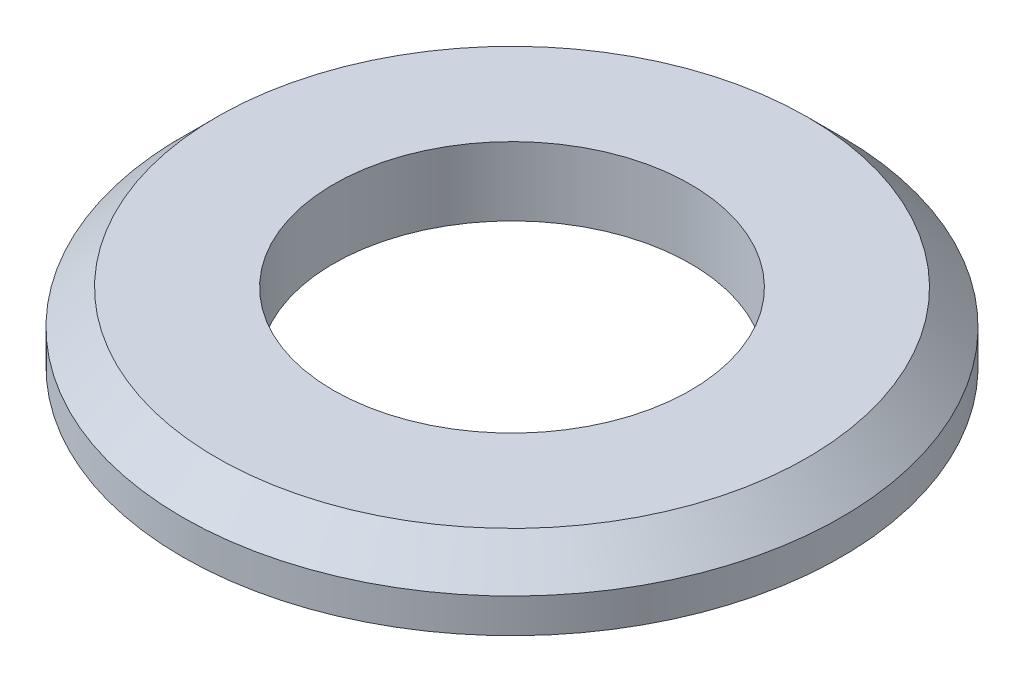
from build123d import *

# Parameters (mm, degrees)
SKETCH1_R      = 12
SKETCH1_R_2    = 6.5
EXTRUDE1_DEPTH = 2.5
CHAMFER1_SIZE  = 1.25


with BuildPart() as part:
    # Sketch1 → Extrude1 (new body)
    with BuildSketch(Plane(origin=(0, 0, 0), x_dir=(1, 0, 0), z_dir=(0, 1, 0))):
        with Locations(Location((0, 0, 0), (0, 0, 270))):
            Circle(SKETCH1_R)
        with Locations(Location((0, 0, 0), (0, 0, 270))):
            Circle(SKETCH1_R_2, mode=Mode.SUBTRACT)
    extrude(amount=EXTRUDE1_DEPTH)

    # Chamfer1
    chamfer1_edges = [part.edges().sort_by_distance(p)[0] for p in [
        (0, 2.5, -12),
    ]]
    chamfer(chamfer1_edges, length=CHAMFER1_SIZE)


solid = part.part
